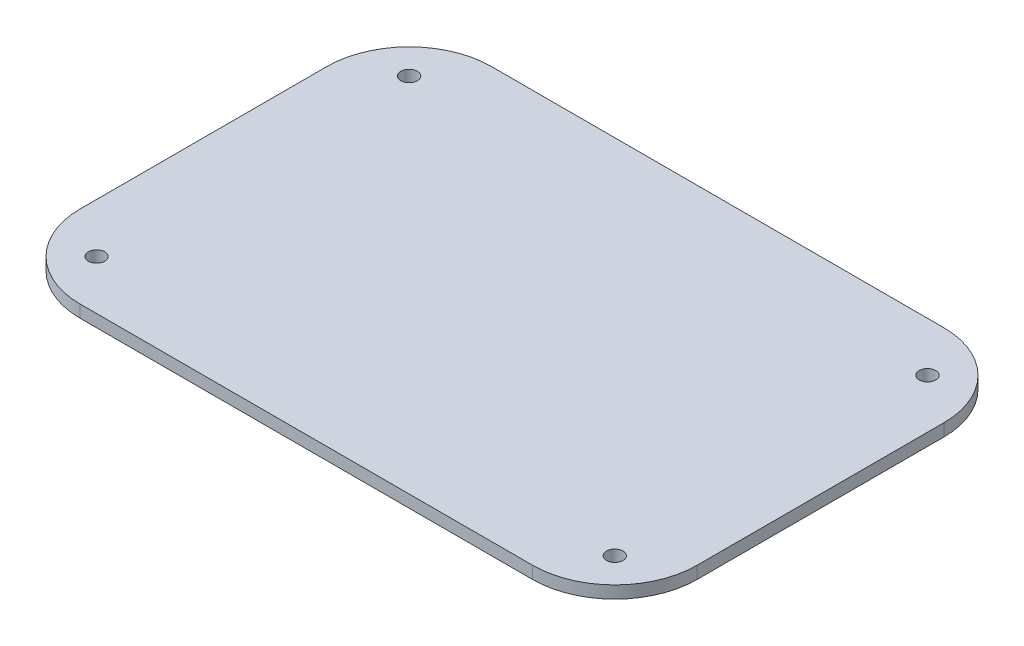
ISO-10303-21;
HEADER;
FILE_DESCRIPTION(('STEP AP214'),'2;1');
FILE_NAME('part.step','',(''),(''),'','','');
FILE_SCHEMA(('AUTOMOTIVE_DESIGN { 1 0 10303 214 1 1 1 1 }'));
ENDSEC;
DATA;
#1=APPLICATION_CONTEXT('core data for automotive mechanical design processes');
#2=APPLICATION_PROTOCOL_DEFINITION('international standard','automotive_design',2000,#1);
#3=PRODUCT_CONTEXT('',#1,'mechanical');
#4=PRODUCT('Part','Part','',(#3));
#5=PRODUCT_RELATED_PRODUCT_CATEGORY('part','',(#4));
#6=PRODUCT_DEFINITION_FORMATION('','',#4);
#7=PRODUCT_DEFINITION_CONTEXT('part definition',#1,'design');
#8=PRODUCT_DEFINITION('design','',#6,#7);
#9=PRODUCT_DEFINITION_SHAPE('','',#8);
#10=(LENGTH_UNIT() NAMED_UNIT(*) SI_UNIT(.MILLI.,.METRE.));
#11=(NAMED_UNIT(*) PLANE_ANGLE_UNIT() SI_UNIT($,.RADIAN.));
#12=(NAMED_UNIT(*) SI_UNIT($,.STERADIAN.) SOLID_ANGLE_UNIT());
#13=UNCERTAINTY_MEASURE_WITH_UNIT(LENGTH_MEASURE(1.E-05),#10,'distance_accuracy_value','');
#14=(GEOMETRIC_REPRESENTATION_CONTEXT(3) GLOBAL_UNCERTAINTY_ASSIGNED_CONTEXT((#13)) GLOBAL_UNIT_ASSIGNED_CONTEXT((#10,
#11,#12)) REPRESENTATION_CONTEXT('',''));
#15=CARTESIAN_POINT('',(0.,0.,0.));
#16=DIRECTION('',(0.,0.,1.));
#17=DIRECTION('',(1.,0.,0.));
#18=AXIS2_PLACEMENT_3D('',#15,#16,#17);
#19=CARTESIAN_POINT('',(-55.,3.,30.));
#20=DIRECTION('',(0.,-1.,0.));
#21=DIRECTION('',(0.,0.,-1.));
#22=AXIS2_PLACEMENT_3D('',#19,#20,#21);
#23=CYLINDRICAL_SURFACE('',#22,20.);
#24=CARTESIAN_POINT('',(-55.,0.,30.));
#25=DIRECTION('',(0.,1.,0.));
#26=DIRECTION('',(0.,0.,1.));
#27=AXIS2_PLACEMENT_3D('',#24,#25,#26);
#28=CIRCLE('',#27,20.);
#29=CARTESIAN_POINT('',(-75.,0.,29.9999999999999));
#30=VERTEX_POINT('',#29);
#31=CARTESIAN_POINT('',(-54.9999999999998,0.,50.));
#32=VERTEX_POINT('',#31);
#33=EDGE_CURVE('E132',#30,#32,#28,.T.);
#34=ORIENTED_EDGE('',*,*,#33,.T.);
#35=DIRECTION('',(0.,-1.,0.));
#36=VECTOR('',#35,1.);
#37=CARTESIAN_POINT('',(-54.9999999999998,3.,50.));
#38=LINE('',#37,#36);
#39=CARTESIAN_POINT('',(-54.9999999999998,3.,50.));
#40=VERTEX_POINT('',#39);
#41=EDGE_CURVE('E11',#40,#32,#38,.T.);
#42=ORIENTED_EDGE('',*,*,#41,.F.);
#43=CARTESIAN_POINT('',(-55.,3.,30.));
#44=DIRECTION('',(0.,1.,0.));
#45=DIRECTION('',(0.,0.,1.));
#46=AXIS2_PLACEMENT_3D('',#43,#44,#45);
#47=CIRCLE('',#46,20.);
#48=CARTESIAN_POINT('',(-75.,3.,29.9999999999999));
#49=VERTEX_POINT('',#48);
#50=EDGE_CURVE('E147',#49,#40,#47,.T.);
#51=ORIENTED_EDGE('',*,*,#50,.F.);
#52=DIRECTION('',(0.,-1.,0.));
#53=VECTOR('',#52,1.);
#54=CARTESIAN_POINT('',(-75.,3.,29.9999999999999));
#55=LINE('',#54,#53);
#56=EDGE_CURVE('E128',#49,#30,#55,.T.);
#57=ORIENTED_EDGE('',*,*,#56,.T.);
#58=EDGE_LOOP('',(#34,#42,#51,#57));
#59=FACE_BOUND('',#58,.T.);
#60=ADVANCED_FACE('F34',(#59),#23,.T.);
#61=CARTESIAN_POINT('',(-54.9999999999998,3.,50.));
#62=DIRECTION('',(0.,0.,-1.));
#63=DIRECTION('',(-1.,0.,0.));
#64=AXIS2_PLACEMENT_3D('',#61,#62,#63);
#65=PLANE('',#64);
#66=DIRECTION('',(1.,0.,0.));
#67=VECTOR('',#66,1.);
#68=CARTESIAN_POINT('',(-54.9999999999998,0.,50.));
#69=LINE('',#68,#67);
#70=CARTESIAN_POINT('',(54.9999999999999,0.,50.));
#71=VERTEX_POINT('',#70);
#72=EDGE_CURVE('E135',#32,#71,#69,.T.);
#73=ORIENTED_EDGE('',*,*,#72,.T.);
#74=DIRECTION('',(0.,-1.,0.));
#75=VECTOR('',#74,1.);
#76=CARTESIAN_POINT('',(54.9999999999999,3.,50.));
#77=LINE('',#76,#75);
#78=CARTESIAN_POINT('',(54.9999999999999,3.,50.));
#79=VERTEX_POINT('',#78);
#80=EDGE_CURVE('E43',#79,#71,#77,.T.);
#81=ORIENTED_EDGE('',*,*,#80,.F.);
#82=DIRECTION('',(1.,0.,0.));
#83=VECTOR('',#82,1.);
#84=CARTESIAN_POINT('',(-54.9999999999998,3.,50.));
#85=LINE('',#84,#83);
#86=EDGE_CURVE('E95',#40,#79,#85,.T.);
#87=ORIENTED_EDGE('',*,*,#86,.F.);
#88=ORIENTED_EDGE('',*,*,#41,.T.);
#89=EDGE_LOOP('',(#73,#81,#87,#88));
#90=FACE_BOUND('',#89,.T.);
#91=ADVANCED_FACE('F217',(#90),#65,.F.);
#92=CARTESIAN_POINT('',(55.,3.,30.));
#93=DIRECTION('',(0.,-1.,0.));
#94=DIRECTION('',(0.,0.,-1.));
#95=AXIS2_PLACEMENT_3D('',#92,#93,#94);
#96=CYLINDRICAL_SURFACE('',#95,20.);
#97=CARTESIAN_POINT('',(55.,0.,30.));
#98=DIRECTION('',(0.,1.,0.));
#99=DIRECTION('',(0.,0.,1.));
#100=AXIS2_PLACEMENT_3D('',#97,#98,#99);
#101=CIRCLE('',#100,20.);
#102=CARTESIAN_POINT('',(75.,0.,29.9999999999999));
#103=VERTEX_POINT('',#102);
#104=EDGE_CURVE('E138',#71,#103,#101,.T.);
#105=ORIENTED_EDGE('',*,*,#104,.T.);
#106=DIRECTION('',(0.,-1.,0.));
#107=VECTOR('',#106,1.);
#108=CARTESIAN_POINT('',(75.,3.,29.9999999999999));
#109=LINE('',#108,#107);
#110=CARTESIAN_POINT('',(75.,3.,29.9999999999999));
#111=VERTEX_POINT('',#110);
#112=EDGE_CURVE('E154',#111,#103,#109,.T.);
#113=ORIENTED_EDGE('',*,*,#112,.F.);
#114=CARTESIAN_POINT('',(55.,3.,30.));
#115=DIRECTION('',(0.,1.,0.));
#116=DIRECTION('',(0.,0.,1.));
#117=AXIS2_PLACEMENT_3D('',#114,#115,#116);
#118=CIRCLE('',#117,20.);
#119=EDGE_CURVE('E184',#79,#111,#118,.T.);
#120=ORIENTED_EDGE('',*,*,#119,.F.);
#121=ORIENTED_EDGE('',*,*,#80,.T.);
#122=EDGE_LOOP('',(#105,#113,#120,#121));
#123=FACE_BOUND('',#122,.T.);
#124=ADVANCED_FACE('F221',(#123),#96,.T.);
#125=CARTESIAN_POINT('',(75.,3.,-29.9999999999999));
#126=DIRECTION('',(-1.,0.,0.));
#127=DIRECTION('',(0.,0.,1.));
#128=AXIS2_PLACEMENT_3D('',#125,#126,#127);
#129=PLANE('',#128);
#130=DIRECTION('',(0.,0.,-1.));
#131=VECTOR('',#130,1.);
#132=CARTESIAN_POINT('',(75.,0.,-29.9999999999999));
#133=LINE('',#132,#131);
#134=CARTESIAN_POINT('',(75.,0.,-29.9999999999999));
#135=VERTEX_POINT('',#134);
#136=EDGE_CURVE('E140',#103,#135,#133,.T.);
#137=ORIENTED_EDGE('',*,*,#136,.T.);
#138=DIRECTION('',(0.,-1.,0.));
#139=VECTOR('',#138,1.);
#140=CARTESIAN_POINT('',(75.,3.,-29.9999999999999));
#141=LINE('',#140,#139);
#142=CARTESIAN_POINT('',(75.,3.,-29.9999999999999));
#143=VERTEX_POINT('',#142);
#144=EDGE_CURVE('E151',#143,#135,#141,.T.);
#145=ORIENTED_EDGE('',*,*,#144,.F.);
#146=DIRECTION('',(0.,0.,-1.));
#147=VECTOR('',#146,1.);
#148=CARTESIAN_POINT('',(75.,3.,-29.9999999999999));
#149=LINE('',#148,#147);
#150=EDGE_CURVE('E186',#111,#143,#149,.T.);
#151=ORIENTED_EDGE('',*,*,#150,.F.);
#152=ORIENTED_EDGE('',*,*,#112,.T.);
#153=EDGE_LOOP('',(#137,#145,#151,#152));
#154=FACE_BOUND('',#153,.T.);
#155=ADVANCED_FACE('F192',(#154),#129,.F.);
#156=CARTESIAN_POINT('',(55.,3.,-30.));
#157=DIRECTION('',(0.,-1.,0.));
#158=DIRECTION('',(0.,0.,-1.));
#159=AXIS2_PLACEMENT_3D('',#156,#157,#158);
#160=CYLINDRICAL_SURFACE('',#159,20.);
#161=CARTESIAN_POINT('',(55.,0.,-30.));
#162=DIRECTION('',(0.,1.,0.));
#163=DIRECTION('',(0.,0.,-1.));
#164=AXIS2_PLACEMENT_3D('',#161,#162,#163);
#165=CIRCLE('',#164,20.);
#166=CARTESIAN_POINT('',(54.9999999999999,0.,-50.));
#167=VERTEX_POINT('',#166);
#168=EDGE_CURVE('E142',#135,#167,#165,.T.);
#169=ORIENTED_EDGE('',*,*,#168,.T.);
#170=DIRECTION('',(0.,-1.,0.));
#171=VECTOR('',#170,1.);
#172=CARTESIAN_POINT('',(54.9999999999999,3.,-50.));
#173=LINE('',#172,#171);
#174=CARTESIAN_POINT('',(54.9999999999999,3.,-50.));
#175=VERTEX_POINT('',#174);
#176=EDGE_CURVE('E123',#175,#167,#173,.T.);
#177=ORIENTED_EDGE('',*,*,#176,.F.);
#178=CARTESIAN_POINT('',(55.,3.,-30.));
#179=DIRECTION('',(0.,1.,0.));
#180=DIRECTION('',(0.,0.,-1.));
#181=AXIS2_PLACEMENT_3D('',#178,#179,#180);
#182=CIRCLE('',#181,20.);
#183=EDGE_CURVE('E114',#143,#175,#182,.T.);
#184=ORIENTED_EDGE('',*,*,#183,.F.);
#185=ORIENTED_EDGE('',*,*,#144,.T.);
#186=EDGE_LOOP('',(#169,#177,#184,#185));
#187=FACE_BOUND('',#186,.T.);
#188=ADVANCED_FACE('F196',(#187),#160,.T.);
#189=CARTESIAN_POINT('',(-54.9999999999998,3.,-50.));
#190=DIRECTION('',(0.,0.,1.));
#191=DIRECTION('',(1.,0.,0.));
#192=AXIS2_PLACEMENT_3D('',#189,#190,#191);
#193=PLANE('',#192);
#194=DIRECTION('',(-1.,0.,0.));
#195=VECTOR('',#194,1.);
#196=CARTESIAN_POINT('',(-54.9999999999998,0.,-50.));
#197=LINE('',#196,#195);
#198=CARTESIAN_POINT('',(-55.,0.,-50.));
#199=VERTEX_POINT('',#198);
#200=EDGE_CURVE('E122',#167,#199,#197,.T.);
#201=ORIENTED_EDGE('',*,*,#200,.T.);
#202=DIRECTION('',(0.,-1.,0.));
#203=VECTOR('',#202,1.);
#204=CARTESIAN_POINT('',(-55.,3.,-50.));
#205=LINE('',#204,#203);
#206=CARTESIAN_POINT('',(-55.,3.,-50.));
#207=VERTEX_POINT('',#206);
#208=EDGE_CURVE('E119',#207,#199,#205,.T.);
#209=ORIENTED_EDGE('',*,*,#208,.F.);
#210=DIRECTION('',(-1.,0.,0.));
#211=VECTOR('',#210,1.);
#212=CARTESIAN_POINT('',(-54.9999999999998,3.,-50.));
#213=LINE('',#212,#211);
#214=EDGE_CURVE('E108',#175,#207,#213,.T.);
#215=ORIENTED_EDGE('',*,*,#214,.F.);
#216=ORIENTED_EDGE('',*,*,#176,.T.);
#217=EDGE_LOOP('',(#201,#209,#215,#216));
#218=FACE_BOUND('',#217,.T.);
#219=ADVANCED_FACE('F120',(#218),#193,.F.);
#220=CARTESIAN_POINT('',(-55.,3.,-30.));
#221=DIRECTION('',(0.,-1.,0.));
#222=DIRECTION('',(0.,0.,-1.));
#223=AXIS2_PLACEMENT_3D('',#220,#221,#222);
#224=CYLINDRICAL_SURFACE('',#223,20.);
#225=CARTESIAN_POINT('',(-55.,0.,-30.));
#226=DIRECTION('',(0.,1.,0.));
#227=DIRECTION('',(0.,0.,-1.));
#228=AXIS2_PLACEMENT_3D('',#225,#226,#227);
#229=CIRCLE('',#228,20.);
#230=CARTESIAN_POINT('',(-75.,0.,-29.9999999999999));
#231=VERTEX_POINT('',#230);
#232=EDGE_CURVE('E81',#199,#231,#229,.T.);
#233=ORIENTED_EDGE('',*,*,#232,.T.);
#234=DIRECTION('',(0.,-1.,0.));
#235=VECTOR('',#234,1.);
#236=CARTESIAN_POINT('',(-75.,3.,-29.9999999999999));
#237=LINE('',#236,#235);
#238=CARTESIAN_POINT('',(-75.,3.,-29.9999999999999));
#239=VERTEX_POINT('',#238);
#240=EDGE_CURVE('E124',#239,#231,#237,.T.);
#241=ORIENTED_EDGE('',*,*,#240,.F.);
#242=CARTESIAN_POINT('',(-55.,3.,-30.));
#243=DIRECTION('',(0.,1.,0.));
#244=DIRECTION('',(0.,0.,-1.));
#245=AXIS2_PLACEMENT_3D('',#242,#243,#244);
#246=CIRCLE('',#245,20.);
#247=EDGE_CURVE('E112',#207,#239,#246,.T.);
#248=ORIENTED_EDGE('',*,*,#247,.F.);
#249=ORIENTED_EDGE('',*,*,#208,.T.);
#250=EDGE_LOOP('',(#233,#241,#248,#249));
#251=FACE_BOUND('',#250,.T.);
#252=ADVANCED_FACE('F126',(#251),#224,.T.);
#253=CARTESIAN_POINT('',(-75.,3.,-29.9999999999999));
#254=DIRECTION('',(1.,0.,0.));
#255=DIRECTION('',(0.,0.,-1.));
#256=AXIS2_PLACEMENT_3D('',#253,#254,#255);
#257=PLANE('',#256);
#258=DIRECTION('',(0.,0.,1.));
#259=VECTOR('',#258,1.);
#260=CARTESIAN_POINT('',(-75.,0.,-29.9999999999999));
#261=LINE('',#260,#259);
#262=EDGE_CURVE('E87',#231,#30,#261,.T.);
#263=ORIENTED_EDGE('',*,*,#262,.T.);
#264=ORIENTED_EDGE('',*,*,#56,.F.);
#265=DIRECTION('',(0.,0.,1.));
#266=VECTOR('',#265,1.);
#267=CARTESIAN_POINT('',(-75.,3.,-29.9999999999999));
#268=LINE('',#267,#266);
#269=EDGE_CURVE('E52',#239,#49,#268,.T.);
#270=ORIENTED_EDGE('',*,*,#269,.F.);
#271=ORIENTED_EDGE('',*,*,#240,.T.);
#272=EDGE_LOOP('',(#263,#264,#270,#271));
#273=FACE_BOUND('',#272,.T.);
#274=ADVANCED_FACE('F204',(#273),#257,.F.);
#275=CARTESIAN_POINT('',(-55.,3.,30.));
#276=DIRECTION('',(0.,1.,0.));
#277=DIRECTION('',(0.,0.,1.));
#278=AXIS2_PLACEMENT_3D('',#275,#276,#277);
#279=PLANE('',#278);
#280=CARTESIAN_POINT('',(-63.,3.,-38.));
#281=DIRECTION('',(0.,-1.,0.));
#282=DIRECTION('',(0.,0.,1.));
#283=AXIS2_PLACEMENT_3D('',#280,#281,#282);
#284=CIRCLE('',#283,2.);
#285=CARTESIAN_POINT('',(-63.,3.,-36.));
#286=VERTEX_POINT('',#285);
#287=EDGE_CURVE('E177',#286,#286,#284,.T.);
#288=ORIENTED_EDGE('',*,*,#287,.T.);
#289=EDGE_LOOP('',(#288));
#290=FACE_BOUND('',#289,.T.);
#291=CARTESIAN_POINT('',(-63.,3.,38.));
#292=DIRECTION('',(0.,1.,0.));
#293=DIRECTION('',(0.,0.,-1.));
#294=AXIS2_PLACEMENT_3D('',#291,#292,#293);
#295=CIRCLE('',#294,2.);
#296=CARTESIAN_POINT('',(-63.,3.,36.));
#297=VERTEX_POINT('',#296);
#298=EDGE_CURVE('E167',#297,#297,#295,.T.);
#299=ORIENTED_EDGE('',*,*,#298,.F.);
#300=EDGE_LOOP('',(#299));
#301=FACE_BOUND('',#300,.T.);
#302=CARTESIAN_POINT('',(63.,3.,38.));
#303=DIRECTION('',(0.,-1.,0.));
#304=DIRECTION('',(0.,0.,-1.));
#305=AXIS2_PLACEMENT_3D('',#302,#303,#304);
#306=CIRCLE('',#305,2.);
#307=CARTESIAN_POINT('',(63.,3.,36.));
#308=VERTEX_POINT('',#307);
#309=EDGE_CURVE('E164',#308,#308,#306,.T.);
#310=ORIENTED_EDGE('',*,*,#309,.T.);
#311=EDGE_LOOP('',(#310));
#312=FACE_BOUND('',#311,.T.);
#313=CARTESIAN_POINT('',(63.,3.,-38.));
#314=DIRECTION('',(0.,1.,0.));
#315=DIRECTION('',(0.,0.,1.));
#316=AXIS2_PLACEMENT_3D('',#313,#314,#315);
#317=CIRCLE('',#316,2.);
#318=CARTESIAN_POINT('',(63.,3.,-36.));
#319=VERTEX_POINT('',#318);
#320=EDGE_CURVE('E161',#319,#319,#317,.T.);
#321=ORIENTED_EDGE('',*,*,#320,.F.);
#322=EDGE_LOOP('',(#321));
#323=FACE_BOUND('',#322,.T.);
#324=ORIENTED_EDGE('',*,*,#50,.T.);
#325=ORIENTED_EDGE('',*,*,#86,.T.);
#326=ORIENTED_EDGE('',*,*,#119,.T.);
#327=ORIENTED_EDGE('',*,*,#150,.T.);
#328=ORIENTED_EDGE('',*,*,#183,.T.);
#329=ORIENTED_EDGE('',*,*,#214,.T.);
#330=ORIENTED_EDGE('',*,*,#247,.T.);
#331=ORIENTED_EDGE('',*,*,#269,.T.);
#332=EDGE_LOOP('',(#324,#325,#326,#327,#328,#329,#330,#331));
#333=FACE_BOUND('',#332,.T.);
#334=ADVANCED_FACE('F110',(#290,#301,#312,#323,#333),#279,.T.);
#335=CARTESIAN_POINT('',(-55.,0.,30.));
#336=DIRECTION('',(0.,1.,0.));
#337=DIRECTION('',(0.,0.,1.));
#338=AXIS2_PLACEMENT_3D('',#335,#336,#337);
#339=PLANE('',#338);
#340=CARTESIAN_POINT('',(-63.,0.,-38.));
#341=DIRECTION('',(0.,1.,0.));
#342=DIRECTION('',(0.,0.,1.));
#343=AXIS2_PLACEMENT_3D('',#340,#341,#342);
#344=CIRCLE('',#343,2.);
#345=CARTESIAN_POINT('',(-63.,0.,-36.));
#346=VERTEX_POINT('',#345);
#347=EDGE_CURVE('E37',#346,#346,#344,.F.);
#348=ORIENTED_EDGE('',*,*,#347,.F.);
#349=EDGE_LOOP('',(#348));
#350=FACE_BOUND('',#349,.T.);
#351=CARTESIAN_POINT('',(-63.,0.,38.));
#352=DIRECTION('',(0.,1.,0.));
#353=DIRECTION('',(0.,0.,1.));
#354=AXIS2_PLACEMENT_3D('',#351,#352,#353);
#355=CIRCLE('',#354,2.);
#356=CARTESIAN_POINT('',(-63.,0.,40.));
#357=VERTEX_POINT('',#356);
#358=EDGE_CURVE('E165',#357,#357,#355,.T.);
#359=ORIENTED_EDGE('',*,*,#358,.T.);
#360=EDGE_LOOP('',(#359));
#361=FACE_BOUND('',#360,.T.);
#362=CARTESIAN_POINT('',(63.,0.,38.));
#363=DIRECTION('',(0.,1.,0.));
#364=DIRECTION('',(0.,0.,1.));
#365=AXIS2_PLACEMENT_3D('',#362,#363,#364);
#366=CIRCLE('',#365,2.);
#367=CARTESIAN_POINT('',(63.,0.,40.));
#368=VERTEX_POINT('',#367);
#369=EDGE_CURVE('E162',#368,#368,#366,.F.);
#370=ORIENTED_EDGE('',*,*,#369,.F.);
#371=EDGE_LOOP('',(#370));
#372=FACE_BOUND('',#371,.T.);
#373=CARTESIAN_POINT('',(63.,0.,-38.));
#374=DIRECTION('',(0.,1.,0.));
#375=DIRECTION('',(0.,0.,1.));
#376=AXIS2_PLACEMENT_3D('',#373,#374,#375);
#377=CIRCLE('',#376,2.);
#378=CARTESIAN_POINT('',(63.,0.,-36.));
#379=VERTEX_POINT('',#378);
#380=EDGE_CURVE('E136',#379,#379,#377,.T.);
#381=ORIENTED_EDGE('',*,*,#380,.T.);
#382=EDGE_LOOP('',(#381));
#383=FACE_BOUND('',#382,.T.);
#384=ORIENTED_EDGE('',*,*,#33,.F.);
#385=ORIENTED_EDGE('',*,*,#262,.F.);
#386=ORIENTED_EDGE('',*,*,#232,.F.);
#387=ORIENTED_EDGE('',*,*,#200,.F.);
#388=ORIENTED_EDGE('',*,*,#168,.F.);
#389=ORIENTED_EDGE('',*,*,#136,.F.);
#390=ORIENTED_EDGE('',*,*,#104,.F.);
#391=ORIENTED_EDGE('',*,*,#72,.F.);
#392=EDGE_LOOP('',(#384,#385,#386,#387,#388,#389,#390,#391));
#393=FACE_BOUND('',#392,.T.);
#394=ADVANCED_FACE('F199',(#350,#361,#372,#383,#393),#339,.F.);
#395=CARTESIAN_POINT('',(63.,-7.,-38.));
#396=DIRECTION('',(0.,1.,0.));
#397=DIRECTION('',(0.,0.,1.));
#398=AXIS2_PLACEMENT_3D('',#395,#396,#397);
#399=CYLINDRICAL_SURFACE('',#398,2.);
#400=ORIENTED_EDGE('',*,*,#320,.T.);
#401=EDGE_LOOP('',(#400));
#402=FACE_BOUND('',#401,.T.);
#403=ORIENTED_EDGE('',*,*,#380,.F.);
#404=EDGE_LOOP('',(#403));
#405=FACE_BOUND('',#404,.T.);
#406=ADVANCED_FACE('F251',(#402,#405),#399,.F.);
#407=CARTESIAN_POINT('',(63.,-7.,38.));
#408=DIRECTION('',(0.,1.,0.));
#409=DIRECTION('',(0.,0.,1.));
#410=AXIS2_PLACEMENT_3D('',#407,#408,#409);
#411=CYLINDRICAL_SURFACE('',#410,2.);
#412=ORIENTED_EDGE('',*,*,#309,.F.);
#413=EDGE_LOOP('',(#412));
#414=FACE_BOUND('',#413,.T.);
#415=ORIENTED_EDGE('',*,*,#369,.T.);
#416=EDGE_LOOP('',(#415));
#417=FACE_BOUND('',#416,.T.);
#418=ADVANCED_FACE('F256',(#414,#417),#411,.F.);
#419=CARTESIAN_POINT('',(-63.,-7.,38.));
#420=DIRECTION('',(0.,1.,0.));
#421=DIRECTION('',(0.,0.,1.));
#422=AXIS2_PLACEMENT_3D('',#419,#420,#421);
#423=CYLINDRICAL_SURFACE('',#422,2.);
#424=ORIENTED_EDGE('',*,*,#298,.T.);
#425=EDGE_LOOP('',(#424));
#426=FACE_BOUND('',#425,.T.);
#427=ORIENTED_EDGE('',*,*,#358,.F.);
#428=EDGE_LOOP('',(#427));
#429=FACE_BOUND('',#428,.T.);
#430=ADVANCED_FACE('F267',(#426,#429),#423,.F.);
#431=CARTESIAN_POINT('',(-63.,-7.,-38.));
#432=DIRECTION('',(0.,1.,0.));
#433=DIRECTION('',(0.,0.,1.));
#434=AXIS2_PLACEMENT_3D('',#431,#432,#433);
#435=CYLINDRICAL_SURFACE('',#434,2.);
#436=ORIENTED_EDGE('',*,*,#287,.F.);
#437=EDGE_LOOP('',(#436));
#438=FACE_BOUND('',#437,.T.);
#439=ORIENTED_EDGE('',*,*,#347,.T.);
#440=EDGE_LOOP('',(#439));
#441=FACE_BOUND('',#440,.T.);
#442=ADVANCED_FACE('F284',(#438,#441),#435,.F.);
#443=CLOSED_SHELL('',(#60,#91,#124,#155,#188,#219,#252,#274,#334,#394,#406,#418,#430,#442));
#444=MANIFOLD_SOLID_BREP('B2',#443);
#445=ADVANCED_BREP_SHAPE_REPRESENTATION('',(#18,#444),#14);
#446=SHAPE_DEFINITION_REPRESENTATION(#9,#445);
ENDSEC;
END-ISO-10303-21;
